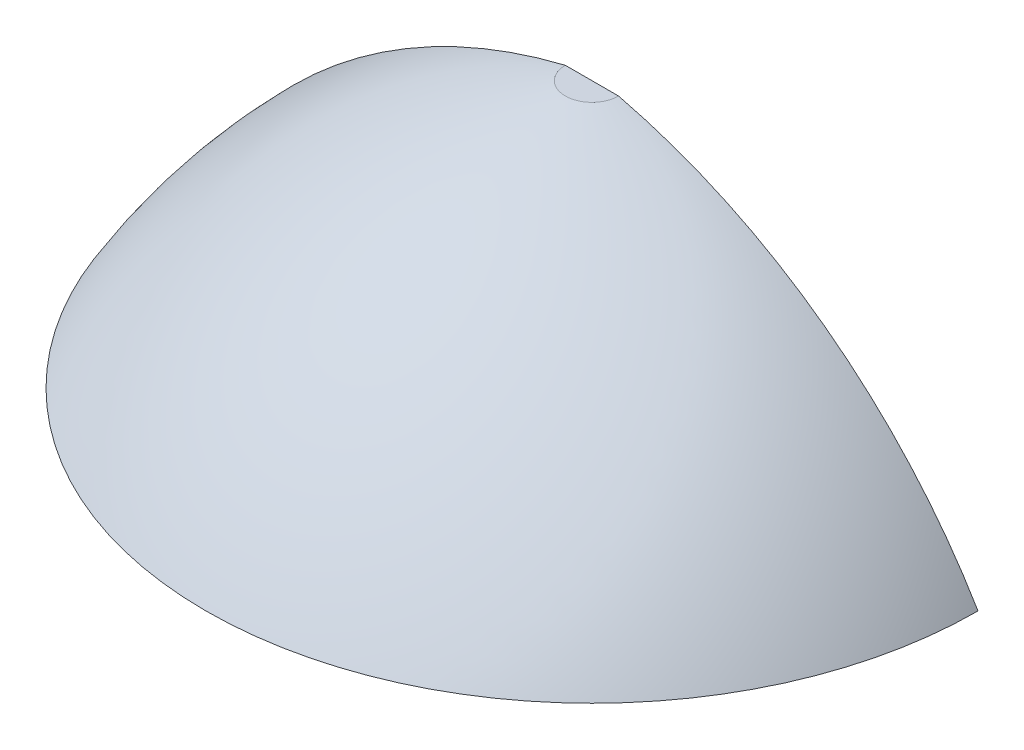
from build123d import *

# Parameters (mm, degrees)
BASE_REVOLVE_ANGLE = 180


with BuildPart() as part:
    # Sketch1 → Base-Revolve (revolve)
    with BuildSketch(Plane.XY):
        with BuildLine():
            Line((0, -9.480179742), (3.683, -9.480179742))
            ThreePointArc((3.683, -9.480179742), (2.225444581, -7.863304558), (0.254, -6.940179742))
            Line((0.254, -6.940179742), (0, -6.940179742))
            Line((0, -6.940179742), (0, -9.480179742))
        make_face()
    revolve(axis=Axis((0, 37.221107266, 0), (0, -1, 0)), revolution_arc=BASE_REVOLVE_ANGLE)


solid = part.part
